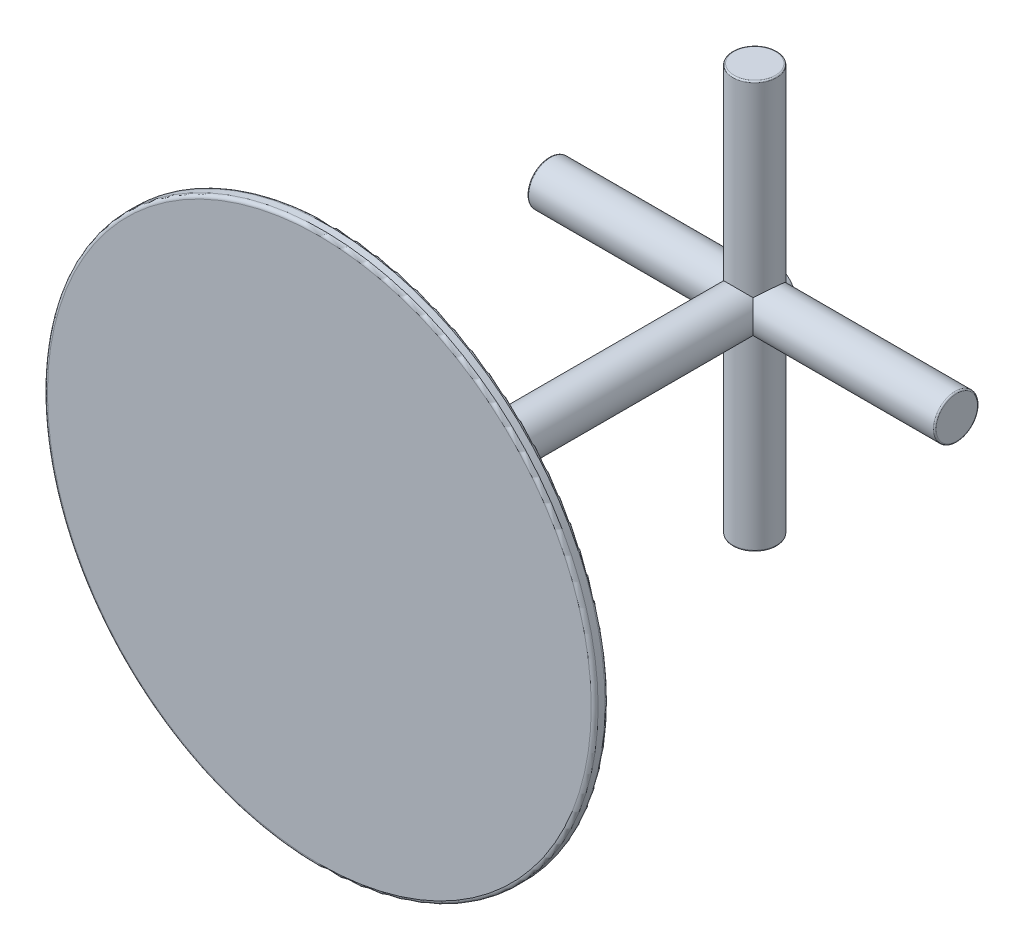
ISO-10303-21;
HEADER;
FILE_DESCRIPTION(('STEP AP214'),'2;1');
FILE_NAME('part.step','',(''),(''),'','','');
FILE_SCHEMA(('AUTOMOTIVE_DESIGN { 1 0 10303 214 1 1 1 1 }'));
ENDSEC;
DATA;
#1=APPLICATION_CONTEXT('core data for automotive mechanical design processes');
#2=APPLICATION_PROTOCOL_DEFINITION('international standard','automotive_design',2000,#1);
#3=PRODUCT_CONTEXT('',#1,'mechanical');
#4=PRODUCT('Part','Part','',(#3));
#5=PRODUCT_RELATED_PRODUCT_CATEGORY('part','',(#4));
#6=PRODUCT_DEFINITION_FORMATION('','',#4);
#7=PRODUCT_DEFINITION_CONTEXT('part definition',#1,'design');
#8=PRODUCT_DEFINITION('design','',#6,#7);
#9=PRODUCT_DEFINITION_SHAPE('','',#8);
#10=(LENGTH_UNIT() NAMED_UNIT(*) SI_UNIT(.MILLI.,.METRE.));
#11=(NAMED_UNIT(*) PLANE_ANGLE_UNIT() SI_UNIT($,.RADIAN.));
#12=(NAMED_UNIT(*) SI_UNIT($,.STERADIAN.) SOLID_ANGLE_UNIT());
#13=UNCERTAINTY_MEASURE_WITH_UNIT(LENGTH_MEASURE(1.E-05),#10,'distance_accuracy_value','');
#14=(GEOMETRIC_REPRESENTATION_CONTEXT(3) GLOBAL_UNCERTAINTY_ASSIGNED_CONTEXT((#13)) GLOBAL_UNIT_ASSIGNED_CONTEXT((#10,
#11,#12)) REPRESENTATION_CONTEXT('',''));
#15=CARTESIAN_POINT('',(0.,0.,0.));
#16=DIRECTION('',(0.,0.,1.));
#17=DIRECTION('',(1.,0.,0.));
#18=AXIS2_PLACEMENT_3D('',#15,#16,#17);
#19=CARTESIAN_POINT('',(0.,0.,-812.8));
#20=DIRECTION('',(0.,0.,1.));
#21=DIRECTION('',(1.,0.,0.));
#22=AXIS2_PLACEMENT_3D('',#19,#20,#21);
#23=CYLINDRICAL_SURFACE('',#22,40.64);
#24=CARTESIAN_POINT('',(0.,0.,0.));
#25=DIRECTION('',(0.,0.,1.));
#26=DIRECTION('',(1.,0.,0.));
#27=AXIS2_PLACEMENT_3D('',#24,#25,#26);
#28=CIRCLE('',#27,40.64);
#29=CARTESIAN_POINT('',(40.64,0.,0.));
#30=VERTEX_POINT('',#29);
#31=EDGE_CURVE('E268',#30,#30,#28,.F.);
#32=ORIENTED_EDGE('',*,*,#31,.T.);
#33=EDGE_LOOP('',(#32));
#34=FACE_BOUND('',#33,.T.);
#35=CARTESIAN_POINT('',(0.,0.,-777.887828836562));
#36=DIRECTION('',(0.,-0.707106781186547,0.707106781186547));
#37=DIRECTION('',(0.,0.707106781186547,0.707106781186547));
#38=AXIS2_PLACEMENT_3D('',#35,#36,#37);
#39=ELLIPSE('',#38,57.4736391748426,40.64);
#40=CARTESIAN_POINT('',(-27.1040751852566,30.2816563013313,-747.60617253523));
#41=VERTEX_POINT('',#40);
#42=CARTESIAN_POINT('',(27.1040751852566,30.2816563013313,-747.60617253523));
#43=VERTEX_POINT('',#42);
#44=EDGE_CURVE('E277',#41,#43,#39,.F.);
#45=ORIENTED_EDGE('',*,*,#44,.F.);
#46=CARTESIAN_POINT('',(0.,0.,-774.710247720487));
#47=DIRECTION('',(0.707106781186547,0.,0.707106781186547));
#48=DIRECTION('',(-0.707106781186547,0.,0.707106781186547));
#49=AXIS2_PLACEMENT_3D('',#46,#47,#48);
#50=ELLIPSE('',#49,57.4736391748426,40.64);
#51=CARTESIAN_POINT('',(-27.1040751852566,-30.2816563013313,-747.60617253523));
#52=VERTEX_POINT('',#51);
#53=EDGE_CURVE('E130',#52,#41,#50,.F.);
#54=ORIENTED_EDGE('',*,*,#53,.F.);
#55=CARTESIAN_POINT('',(0.,0.,-777.887828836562));
#56=DIRECTION('',(0.,0.707106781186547,0.707106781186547));
#57=DIRECTION('',(0.,-0.707106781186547,0.707106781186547));
#58=AXIS2_PLACEMENT_3D('',#55,#56,#57);
#59=ELLIPSE('',#58,57.4736391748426,40.64);
#60=CARTESIAN_POINT('',(27.1040751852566,-30.2816563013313,-747.60617253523));
#61=VERTEX_POINT('',#60);
#62=EDGE_CURVE('E49',#61,#52,#59,.F.);
#63=ORIENTED_EDGE('',*,*,#62,.F.);
#64=CARTESIAN_POINT('',(0.,0.,-774.710247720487));
#65=DIRECTION('',(-0.707106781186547,0.,0.707106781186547));
#66=DIRECTION('',(0.707106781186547,0.,0.707106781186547));
#67=AXIS2_PLACEMENT_3D('',#64,#65,#66);
#68=ELLIPSE('',#67,57.4736391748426,40.64);
#69=EDGE_CURVE('E122',#43,#61,#68,.F.);
#70=ORIENTED_EDGE('',*,*,#69,.F.);
#71=EDGE_LOOP('',(#45,#54,#63,#70));
#72=FACE_BOUND('',#71,.T.);
#73=ADVANCED_FACE('F34',(#34,#72),#23,.T.);
#74=CARTESIAN_POINT('',(375.92,0.,-774.710247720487));
#75=DIRECTION('',(-1.,0.,0.));
#76=DIRECTION('',(0.,0.,1.));
#77=AXIS2_PLACEMENT_3D('',#74,#75,#76);
#78=CYLINDRICAL_SURFACE('',#77,40.64);
#79=CARTESIAN_POINT('',(373.38,0.,-774.710247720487));
#80=DIRECTION('',(1.,0.,0.));
#81=DIRECTION('',(0.,0.,-1.));
#82=AXIS2_PLACEMENT_3D('',#79,#80,#81);
#83=CIRCLE('',#82,40.64);
#84=CARTESIAN_POINT('',(373.38,0.,-815.350247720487));
#85=VERTEX_POINT('',#84);
#86=EDGE_CURVE('E42',#85,#85,#83,.F.);
#87=ORIENTED_EDGE('',*,*,#86,.T.);
#88=EDGE_LOOP('',(#87));
#89=FACE_BOUND('',#88,.T.);
#90=CARTESIAN_POINT('',(15.7536272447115,0.,-815.350247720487));
#91=CARTESIAN_POINT('',(15.7536463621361,-0.572463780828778,-815.350243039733));
#92=CARTESIAN_POINT('',(15.7825989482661,-1.14500885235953,-815.338104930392));
#93=CARTESIAN_POINT('',(15.8961397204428,-2.28353403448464,-815.290047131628));
#94=CARTESIAN_POINT('',(15.980743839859,-2.84951221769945,-815.254120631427));
#95=CARTESIAN_POINT('',(16.1999254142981,-3.97201147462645,-815.159616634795));
#96=CARTESIAN_POINT('',(16.3347071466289,-4.52848402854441,-815.100946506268));
#97=CARTESIAN_POINT('',(16.6462870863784,-5.62703430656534,-814.962613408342));
#98=CARTESIAN_POINT('',(16.8231108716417,-6.16910304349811,-814.882937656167));
#99=CARTESIAN_POINT('',(17.1664936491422,-7.11587647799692,-814.724607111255));
#100=CARTESIAN_POINT('',(17.3262256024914,-7.52375962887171,-814.649849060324));
#101=CARTESIAN_POINT('',(17.6624950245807,-8.33015017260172,-814.489476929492));
#102=CARTESIAN_POINT('',(17.8390268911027,-8.72866063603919,-814.403866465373));
#103=CARTESIAN_POINT('',(18.3896560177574,-9.91146514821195,-814.131410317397));
#104=CARTESIAN_POINT('',(18.7845930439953,-10.6825199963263,-813.92902709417));
#105=CARTESIAN_POINT('',(19.6124136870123,-12.1952089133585,-813.485365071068));
#106=CARTESIAN_POINT('',(20.0454133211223,-12.9367422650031,-813.243965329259));
#107=CARTESIAN_POINT('',(20.935212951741,-14.3918253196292,-812.724474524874));
#108=CARTESIAN_POINT('',(21.3920082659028,-15.1053804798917,-812.446390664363));
#109=CARTESIAN_POINT('',(22.2681748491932,-16.4292000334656,-811.887494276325));
#110=CARTESIAN_POINT('',(22.686016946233,-17.0420903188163,-811.610466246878));
#111=CARTESIAN_POINT('',(23.5282792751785,-18.2498506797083,-811.028314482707));
#112=CARTESIAN_POINT('',(23.9527002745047,-18.8447186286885,-810.723187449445));
#113=CARTESIAN_POINT('',(24.8043713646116,-20.0176494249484,-810.084665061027));
#114=CARTESIAN_POINT('',(25.2316230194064,-20.5957018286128,-809.751252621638));
#115=CARTESIAN_POINT('',(26.0853899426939,-21.7350627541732,-809.056163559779));
#116=CARTESIAN_POINT('',(26.5119052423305,-22.2963720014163,-808.694488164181));
#117=CARTESIAN_POINT('',(27.3606589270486,-23.4014297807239,-807.943187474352));
#118=CARTESIAN_POINT('',(27.7829032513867,-23.9452059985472,-807.553609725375));
#119=CARTESIAN_POINT('',(28.6212046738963,-25.0158091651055,-806.745675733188));
#120=CARTESIAN_POINT('',(29.0372615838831,-25.5426355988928,-806.327318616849));
#121=CARTESIAN_POINT('',(30.2720524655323,-27.0963191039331,-805.028900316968));
#122=CARTESIAN_POINT('',(31.0781230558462,-28.097304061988,-804.104866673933));
#123=CARTESIAN_POINT('',(32.4094532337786,-29.740581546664,-802.424104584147));
#124=CARTESIAN_POINT('',(32.9481565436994,-30.4024732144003,-801.696964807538));
#125=CARTESIAN_POINT('',(33.9915473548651,-31.6825325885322,-800.181994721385));
#126=CARTESIAN_POINT('',(34.4962360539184,-32.30070183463,-799.39416655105));
#127=CARTESIAN_POINT('',(35.4633177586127,-33.4870581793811,-797.759011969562));
#128=CARTESIAN_POINT('',(35.9257637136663,-34.0553078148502,-796.911762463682));
#129=CARTESIAN_POINT('',(36.8009091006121,-35.1362357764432,-795.158102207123));
#130=CARTESIAN_POINT('',(37.213618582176,-35.6489253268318,-794.251703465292));
#131=CARTESIAN_POINT('',(37.907212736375,-36.5193195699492,-792.561615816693));
#132=CARTESIAN_POINT('',(38.198207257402,-36.8879029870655,-791.78766438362));
#133=CARTESIAN_POINT('',(38.7373888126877,-37.579983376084,-790.205400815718));
#134=CARTESIAN_POINT('',(38.9855804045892,-37.903485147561,-789.397092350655));
#135=CARTESIAN_POINT('',(39.4344616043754,-38.5012127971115,-787.749934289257));
#136=CARTESIAN_POINT('',(39.6351698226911,-38.7754579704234,-786.911096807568));
#137=CARTESIAN_POINT('',(39.984888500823,-39.2709656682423,-785.207287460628));
#138=CARTESIAN_POINT('',(40.1338984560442,-39.4922276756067,-784.342315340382));
#139=CARTESIAN_POINT('',(40.377242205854,-39.879646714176,-782.58657771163));
#140=CARTESIAN_POINT('',(40.4712209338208,-40.0454429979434,-781.695682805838));
#141=CARTESIAN_POINT('',(40.6001008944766,-40.3174193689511,-779.90055705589));
#142=CARTESIAN_POINT('',(40.6350019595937,-40.4235992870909,-778.996326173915));
#143=CARTESIAN_POINT('',(40.6439970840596,-40.5749224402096,-777.182710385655));
#144=CARTESIAN_POINT('',(40.618108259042,-40.6200828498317,-776.273327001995));
#145=CARTESIAN_POINT('',(40.5051767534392,-40.6493555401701,-774.457429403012));
#146=CARTESIAN_POINT('',(40.4181385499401,-40.6334722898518,-773.550914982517));
#147=CARTESIAN_POINT('',(40.1958795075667,-40.5466695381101,-771.840764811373));
#148=CARTESIAN_POINT('',(40.0664766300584,-40.4815270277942,-771.036064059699));
#149=CARTESIAN_POINT('',(39.7607590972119,-40.3049271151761,-769.440873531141));
#150=CARTESIAN_POINT('',(39.5844483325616,-40.1934735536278,-768.650382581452));
#151=CARTESIAN_POINT('',(39.1870975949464,-39.9267193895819,-767.088260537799));
#152=CARTESIAN_POINT('',(38.9660537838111,-39.7714150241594,-766.316631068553));
#153=CARTESIAN_POINT('',(38.4818997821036,-39.4199317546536,-764.796243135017));
#154=CARTESIAN_POINT('',(38.218787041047,-39.2237503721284,-764.047486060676));
#155=CARTESIAN_POINT('',(37.6385176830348,-38.7824576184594,-762.537257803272));
#156=CARTESIAN_POINT('',(37.3192432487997,-38.5353120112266,-761.777197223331));
#157=CARTESIAN_POINT('',(36.6408586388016,-38.0033671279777,-760.288792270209));
#158=CARTESIAN_POINT('',(36.2817482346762,-37.7185676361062,-759.560448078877));
#159=CARTESIAN_POINT('',(35.5270820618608,-37.1152691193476,-758.137259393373));
#160=CARTESIAN_POINT('',(35.1315189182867,-36.796763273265,-757.44242172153));
#161=CARTESIAN_POINT('',(34.3071791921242,-36.1299275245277,-756.087459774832));
#162=CARTESIAN_POINT('',(33.878395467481,-35.7815912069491,-755.427343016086));
#163=CARTESIAN_POINT('',(33.0920202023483,-35.1413962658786,-754.289292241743));
#164=CARTESIAN_POINT('',(32.7405123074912,-34.8547896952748,-753.804160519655));
#165=CARTESIAN_POINT('',(32.0208506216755,-34.2677774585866,-752.855264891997));
#166=CARTESIAN_POINT('',(31.652699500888,-33.9673740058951,-752.391497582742));
#167=CARTESIAN_POINT('',(30.5245136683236,-33.0474502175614,-751.031702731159));
#168=CARTESIAN_POINT('',(29.7409434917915,-32.4093775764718,-750.167465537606));
#169=CARTESIAN_POINT('',(28.1166632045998,-31.0942442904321,-748.521102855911));
#170=CARTESIAN_POINT('',(27.2757954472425,-30.4170769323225,-747.739220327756));
#171=CARTESIAN_POINT('',(25.5440407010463,-29.0368008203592,-746.258582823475));
#172=CARTESIAN_POINT('',(24.653163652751,-28.3336972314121,-745.559811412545));
#173=CARTESIAN_POINT('',(23.269554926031,-27.259237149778,-744.56409301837));
#174=CARTESIAN_POINT('',(22.794129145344,-26.893009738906,-744.237133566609));
#175=CARTESIAN_POINT('',(21.8308951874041,-26.1585642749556,-743.604397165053));
#176=CARTESIAN_POINT('',(21.3430878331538,-25.7903463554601,-743.298618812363));
#177=CARTESIAN_POINT('',(20.3547489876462,-25.0536261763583,-742.707928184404));
#178=CARTESIAN_POINT('',(19.8542111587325,-24.6851238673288,-742.423026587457));
#179=CARTESIAN_POINT('',(18.8403146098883,-23.9501803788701,-741.874158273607));
#180=CARTESIAN_POINT('',(18.326956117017,-23.5837391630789,-741.610191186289));
#181=CARTESIAN_POINT('',(17.2881049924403,-22.8563498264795,-741.103808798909));
#182=CARTESIAN_POINT('',(16.7626456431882,-22.495390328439,-740.861341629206));
#183=CARTESIAN_POINT('',(15.6974301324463,-21.7810544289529,-740.397325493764));
#184=CARTESIAN_POINT('',(15.157672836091,-21.4276786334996,-740.175778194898));
#185=CARTESIAN_POINT('',(14.0631790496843,-20.7326628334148,-739.754113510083));
#186=CARTESIAN_POINT('',(13.5084566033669,-20.3910124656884,-739.553976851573));
#187=CARTESIAN_POINT('',(12.3821301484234,-19.7240285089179,-739.17548741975));
#188=CARTESIAN_POINT('',(11.8105302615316,-19.3986909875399,-738.997129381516));
#189=CARTESIAN_POINT('',(10.7352464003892,-18.8174686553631,-738.687974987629));
#190=CARTESIAN_POINT('',(10.2341551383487,-18.5584641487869,-738.554052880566));
#191=CARTESIAN_POINT('',(9.21720433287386,-18.0617936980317,-738.303400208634));
#192=CARTESIAN_POINT('',(8.70134477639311,-17.824127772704,-738.186669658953));
#193=CARTESIAN_POINT('',(7.65485229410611,-17.3767061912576,-737.97169580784));
#194=CARTESIAN_POINT('',(7.12424579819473,-17.1669040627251,-737.873421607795));
#195=CARTESIAN_POINT('',(6.04724761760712,-16.782179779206,-737.696561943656));
#196=CARTESIAN_POINT('',(5.50085948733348,-16.6072498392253,-737.617972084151));
#197=CARTESIAN_POINT('',(4.49619421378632,-16.3289795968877,-737.494757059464));
#198=CARTESIAN_POINT('',(4.04038028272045,-16.2183784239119,-737.446535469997));
#199=CARTESIAN_POINT('',(3.12061733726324,-16.0301822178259,-737.365188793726));
#200=CARTESIAN_POINT('',(2.65666942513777,-15.9525827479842,-737.332061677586));
#201=CARTESIAN_POINT('',(1.7239800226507,-15.8341383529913,-737.281731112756));
#202=CARTESIAN_POINT('',(1.25524795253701,-15.7932315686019,-737.264500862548));
#203=CARTESIAN_POINT('',(0.315668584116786,-15.7501020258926,-737.246338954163));
#204=CARTESIAN_POINT('',(-0.155178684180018,-15.7478787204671,-737.245407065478));
#205=CARTESIAN_POINT('',(-1.09528292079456,-15.7822413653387,-737.259870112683));
#206=CARTESIAN_POINT('',(-1.56453951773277,-15.8188358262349,-737.275268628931));
#207=CARTESIAN_POINT('',(-2.49785810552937,-15.928904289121,-737.321972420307));
#208=CARTESIAN_POINT('',(-2.96191984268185,-16.0023800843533,-737.35327846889));
#209=CARTESIAN_POINT('',(-3.88307539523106,-16.1828818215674,-737.431117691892));
#210=CARTESIAN_POINT('',(-4.3401530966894,-16.2899757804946,-737.477681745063));
#211=CARTESIAN_POINT('',(-5.24470119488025,-16.5333122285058,-737.585096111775));
#212=CARTESIAN_POINT('',(-5.69217043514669,-16.6695582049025,-737.6459481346));
#213=CARTESIAN_POINT('',(-6.8993241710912,-17.0750239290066,-737.830275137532));
#214=CARTESIAN_POINT('',(-7.64876216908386,-17.3687656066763,-737.967059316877));
#215=CARTESIAN_POINT('',(-9.11708842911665,-18.0089623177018,-738.276562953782));
#216=CARTESIAN_POINT('',(-9.83595004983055,-18.3554621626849,-738.449313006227));
#217=CARTESIAN_POINT('',(-11.2484871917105,-19.0864437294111,-738.828670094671));
#218=CARTESIAN_POINT('',(-11.9420494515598,-19.4710729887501,-739.035410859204));
#219=CARTESIAN_POINT('',(-13.3039742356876,-20.2651919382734,-739.480446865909));
#220=CARTESIAN_POINT('',(-13.9723418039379,-20.6746766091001,-739.718735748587));
#221=CARTESIAN_POINT('',(-15.25563700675,-21.4901847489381,-740.213894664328));
#222=CARTESIAN_POINT('',(-15.8715961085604,-21.8954525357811,-740.469348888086));
#223=CARTESIAN_POINT('',(-17.0851715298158,-22.7153133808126,-741.007655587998));
#224=CARTESIAN_POINT('',(-17.6827851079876,-23.1299078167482,-741.290512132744));
#225=CARTESIAN_POINT('',(-18.8612082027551,-23.9642928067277,-741.883665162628));
#226=CARTESIAN_POINT('',(-19.4420059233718,-24.3840867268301,-742.193980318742));
#227=CARTESIAN_POINT('',(-20.5870796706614,-25.2250318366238,-742.841938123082));
#228=CARTESIAN_POINT('',(-21.1513565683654,-25.646182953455,-743.179579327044));
#229=CARTESIAN_POINT('',(-22.263082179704,-26.4863756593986,-743.881997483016));
#230=CARTESIAN_POINT('',(-22.8105498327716,-26.9054191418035,-744.246742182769));
#231=CARTESIAN_POINT('',(-23.8893026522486,-27.7392620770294,-745.004016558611));
#232=CARTESIAN_POINT('',(-24.4205873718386,-28.1540614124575,-745.396547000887));
#233=CARTESIAN_POINT('',(-25.4663155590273,-28.9767639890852,-746.20952818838));
#234=CARTESIAN_POINT('',(-25.9807675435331,-29.384670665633,-746.629964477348));
#235=CARTESIAN_POINT('',(-26.992371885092,-30.1914302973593,-747.499242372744));
#236=CARTESIAN_POINT('',(-27.4895254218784,-30.5902838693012,-747.948082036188));
#237=CARTESIAN_POINT('',(-28.7059580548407,-31.5702873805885,-749.102659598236));
#238=CARTESIAN_POINT('',(-29.4141370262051,-32.1445452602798,-749.826113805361));
#239=CARTESIAN_POINT('',(-30.7857174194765,-33.260074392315,-751.338043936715));
#240=CARTESIAN_POINT('',(-31.4491188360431,-33.8013456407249,-752.126519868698));
#241=CARTESIAN_POINT('',(-32.7248332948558,-34.8420467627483,-753.767856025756));
#242=CARTESIAN_POINT('',(-33.3372189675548,-35.3415361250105,-754.620621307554));
#243=CARTESIAN_POINT('',(-34.2129024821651,-36.0531505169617,-755.947732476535));
#244=CARTESIAN_POINT('',(-34.4976328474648,-36.2840733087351,-756.398069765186));
#245=CARTESIAN_POINT('',(-35.0520106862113,-36.7323469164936,-757.314712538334));
#246=CARTESIAN_POINT('',(-35.3216543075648,-36.9496942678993,-757.781022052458));
#247=CARTESIAN_POINT('',(-35.9975702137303,-37.4921785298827,-759.006093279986));
#248=CARTESIAN_POINT('',(-36.3916832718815,-37.8061477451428,-759.776628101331));
#249=CARTESIAN_POINT('',(-37.1350610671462,-38.3918811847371,-761.354314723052));
#250=CARTESIAN_POINT('',(-37.4843359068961,-38.6636549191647,-762.161458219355));
#251=CARTESIAN_POINT('',(-38.1337583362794,-39.160121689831,-763.809129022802));
#252=CARTESIAN_POINT('',(-38.4339207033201,-39.3848288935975,-764.649646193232));
#253=CARTESIAN_POINT('',(-38.9810357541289,-39.7825468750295,-766.359846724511));
#254=CARTESIAN_POINT('',(-39.2279878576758,-39.955557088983,-767.229530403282));
#255=CARTESIAN_POINT('',(-39.6664660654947,-40.246696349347,-768.998657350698));
#256=CARTESIAN_POINT('',(-39.8575819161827,-40.3644228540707,-769.89826933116));
#257=CARTESIAN_POINT('',(-40.1789179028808,-40.5396714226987,-771.714157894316));
#258=CARTESIAN_POINT('',(-40.3091378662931,-40.5971933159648,-772.630434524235));
#259=CARTESIAN_POINT('',(-40.5066976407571,-40.6497214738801,-774.471173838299));
#260=CARTESIAN_POINT('',(-40.5740628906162,-40.6447530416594,-775.395633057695));
#261=CARTESIAN_POINT('',(-40.6454328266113,-40.5714568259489,-777.244436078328));
#262=CARTESIAN_POINT('',(-40.6494432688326,-40.5031347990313,-778.168779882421));
#263=CARTESIAN_POINT('',(-40.5981452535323,-40.3150600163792,-779.904384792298));
#264=CARTESIAN_POINT('',(-40.549508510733,-40.2020141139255,-780.716588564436));
#265=CARTESIAN_POINT('',(-40.4047626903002,-39.9279386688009,-782.32848272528));
#266=CARTESIAN_POINT('',(-40.3086579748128,-39.7669135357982,-783.128174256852));
#267=CARTESIAN_POINT('',(-40.0712671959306,-39.398892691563,-784.710071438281));
#268=CARTESIAN_POINT('',(-39.9299781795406,-39.1918939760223,-785.492275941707));
#269=CARTESIAN_POINT('',(-39.6050823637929,-38.7344869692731,-787.034875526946));
#270=CARTESIAN_POINT('',(-39.421473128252,-38.4840761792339,-787.795269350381));
#271=CARTESIAN_POINT('',(-39.0077120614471,-37.9327973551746,-789.318198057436));
#272=CARTESIAN_POINT('',(-38.7760978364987,-37.6304132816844,-790.079784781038));
#273=CARTESIAN_POINT('',(-38.2747163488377,-36.9855163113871,-791.57270487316));
#274=CARTESIAN_POINT('',(-38.0049492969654,-36.6430036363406,-792.304038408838));
#275=CARTESIAN_POINT('',(-37.431093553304,-35.92115737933,-793.734498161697));
#276=CARTESIAN_POINT('',(-37.1269967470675,-35.5418150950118,-794.433616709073));
#277=CARTESIAN_POINT('',(-36.4882854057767,-34.7495243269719,-795.798225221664));
#278=CARTESIAN_POINT('',(-36.1536643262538,-34.3365686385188,-796.463707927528));
#279=CARTESIAN_POINT('',(-35.539883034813,-33.5813139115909,-797.606908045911));
#280=CARTESIAN_POINT('',(-35.2662902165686,-33.2453630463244,-798.09184978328));
#281=CARTESIAN_POINT('',(-34.7051158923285,-32.5569367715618,-799.041282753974));
#282=CARTESIAN_POINT('',(-34.4175366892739,-32.2044640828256,-799.505777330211));
#283=CARTESIAN_POINT('',(-33.5357284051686,-31.1235086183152,-800.869039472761));
#284=CARTESIAN_POINT('',(-32.922573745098,-30.3716661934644,-801.737318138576));
#285=CARTESIAN_POINT('',(-31.6560460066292,-28.8117434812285,-803.394598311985));
#286=CARTESIAN_POINT('',(-31.0025760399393,-28.0035270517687,-804.183395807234));
#287=CARTESIAN_POINT('',(-29.6675350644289,-26.3379001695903,-805.680856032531));
#288=CARTESIAN_POINT('',(-28.9859687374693,-25.4804979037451,-806.389532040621));
#289=CARTESIAN_POINT('',(-27.9420049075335,-24.148876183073,-807.402185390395));
#290=CARTESIAN_POINT('',(-27.585871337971,-23.6914650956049,-807.735131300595));
#291=CARTESIAN_POINT('',(-26.8706271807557,-22.7647491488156,-808.380630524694));
#292=CARTESIAN_POINT('',(-26.511516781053,-22.2954450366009,-808.693185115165));
#293=CARTESIAN_POINT('',(-25.7918417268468,-21.344801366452,-809.298202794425));
#294=CARTESIAN_POINT('',(-25.4312765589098,-20.8634571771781,-809.590657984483));
#295=CARTESIAN_POINT('',(-24.7106986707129,-19.8887721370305,-810.155467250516));
#296=CARTESIAN_POINT('',(-24.3506859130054,-19.3954321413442,-810.427822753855));
#297=CARTESIAN_POINT('',(-23.6340383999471,-18.3973665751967,-810.95198595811));
#298=CARTESIAN_POINT('',(-23.2773982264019,-17.8926664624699,-811.203834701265));
#299=CARTESIAN_POINT('',(-22.5692077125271,-16.8702437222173,-811.687597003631));
#300=CARTESIAN_POINT('',(-22.2176576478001,-16.3525203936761,-811.91950948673));
#301=CARTESIAN_POINT('',(-21.5229113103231,-15.3035032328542,-812.363089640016));
#302=CARTESIAN_POINT('',(-21.1797097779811,-14.7722184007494,-812.57477031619));
#303=CARTESIAN_POINT('',(-20.505238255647,-13.6946199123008,-812.977699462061));
#304=CARTESIAN_POINT('',(-20.1739662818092,-13.1483087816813,-813.168951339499));
#305=CARTESIAN_POINT('',(-19.5596352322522,-12.0931830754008,-813.5128457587));
#306=CARTESIAN_POINT('',(-19.2750255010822,-11.5859099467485,-813.667434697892));
#307=CARTESIAN_POINT('',(-18.7239464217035,-10.5565526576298,-813.958877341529));
#308=CARTESIAN_POINT('',(-18.4574768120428,-10.0344687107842,-814.095731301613));
#309=CARTESIAN_POINT('',(-17.9485646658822,-8.97455287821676,-814.350680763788));
#310=CARTESIAN_POINT('',(-17.7061078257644,-8.4367306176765,-814.468787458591));
#311=CARTESIAN_POINT('',(-17.2522146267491,-7.34414461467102,-814.685028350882));
#312=CARTESIAN_POINT('',(-17.0407730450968,-6.78938374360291,-814.783165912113));
#313=CARTESIAN_POINT('',(-16.6919752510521,-5.76434573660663,-814.942079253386));
#314=CARTESIAN_POINT('',(-16.5481344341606,-5.29683887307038,-815.006400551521));
#315=CARTESIAN_POINT('',(-16.2922560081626,-4.3513954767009,-815.11942292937));
#316=CARTESIAN_POINT('',(-16.180207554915,-3.87346256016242,-815.168129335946));
#317=CARTESIAN_POINT('',(-15.9930755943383,-2.91014882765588,-815.248792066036));
#318=CARTESIAN_POINT('',(-15.9179014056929,-2.42478934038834,-815.280789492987));
#319=CARTESIAN_POINT('',(-15.8080617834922,-1.44863504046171,-815.327358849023));
#320=CARTESIAN_POINT('',(-15.7733934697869,-0.957840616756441,-815.341932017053));
#321=CARTESIAN_POINT('',(-15.7465144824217,0.0276978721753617,-815.353241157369));
#322=CARTESIAN_POINT('',(-15.7545258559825,0.522449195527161,-815.349883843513));
#323=CARTESIAN_POINT('',(-15.8130361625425,1.50895144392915,-815.325222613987));
#324=CARTESIAN_POINT('',(-15.8635366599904,2.00070225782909,-815.303918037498));
#325=CARTESIAN_POINT('',(-16.0042911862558,2.9784150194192,-815.243926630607));
#326=CARTESIAN_POINT('',(-16.0946316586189,3.46436200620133,-815.205201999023));
#327=CARTESIAN_POINT('',(-16.3105451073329,4.42668435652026,-815.11133653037));
#328=CARTESIAN_POINT('',(-16.4361239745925,4.90305810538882,-815.056192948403));
#329=CARTESIAN_POINT('',(-16.7892727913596,6.08572329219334,-814.898420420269));
#330=CARTESIAN_POINT('',(-17.0361503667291,6.78493109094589,-814.785931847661));
#331=CARTESIAN_POINT('',(-17.5812119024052,8.15699562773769,-814.529352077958));
#332=CARTESIAN_POINT('',(-17.8794308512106,8.82983400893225,-814.385239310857));
#333=CARTESIAN_POINT('',(-18.5140911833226,10.1531002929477,-814.067443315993));
#334=CARTESIAN_POINT('',(-18.850675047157,10.8034321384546,-813.893648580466));
#335=CARTESIAN_POINT('',(-19.550180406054,12.0813286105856,-813.518680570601));
#336=CARTESIAN_POINT('',(-19.9130981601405,12.7088964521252,-813.317511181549));
#337=CARTESIAN_POINT('',(-20.6569324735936,13.9433035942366,-812.88904180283));
#338=CARTESIAN_POINT('',(-21.0378348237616,14.5501586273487,-812.661762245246));
#339=CARTESIAN_POINT('',(-21.8119076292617,15.7457208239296,-812.18152874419));
#340=CARTESIAN_POINT('',(-22.205080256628,16.3344247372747,-811.928570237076));
#341=CARTESIAN_POINT('',(-22.9992614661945,17.4954686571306,-811.397112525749));
#342=CARTESIAN_POINT('',(-23.4002756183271,18.0677962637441,-811.11859460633));
#343=CARTESIAN_POINT('',(-24.206123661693,19.1965988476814,-810.536264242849));
#344=CARTESIAN_POINT('',(-24.6109573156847,19.753074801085,-810.232453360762));
#345=CARTESIAN_POINT('',(-25.4212522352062,20.8505810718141,-809.599557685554));
#346=CARTESIAN_POINT('',(-25.826713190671,21.3916173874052,-809.270482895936));
#347=CARTESIAN_POINT('',(-26.6358091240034,22.4587096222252,-808.586751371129));
#348=CARTESIAN_POINT('',(-27.0394440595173,22.984765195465,-808.232094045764));
#349=CARTESIAN_POINT('',(-27.8423520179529,24.0215590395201,-807.497102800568));
#350=CARTESIAN_POINT('',(-28.2416270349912,24.5323045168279,-807.116781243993));
#351=CARTESIAN_POINT('',(-29.0338018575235,25.5383196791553,-806.330044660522));
#352=CARTESIAN_POINT('',(-29.4267019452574,26.0335900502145,-805.923630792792));
#353=CARTESIAN_POINT('',(-30.4485026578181,27.3145119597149,-804.820448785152));
#354=CARTESIAN_POINT('',(-31.0705024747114,28.0869956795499,-804.101754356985));
#355=CARTESIAN_POINT('',(-32.2832318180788,29.5854481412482,-802.59288554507));
#356=CARTESIAN_POINT('',(-32.8739596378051,30.3114143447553,-801.802707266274));
#357=CARTESIAN_POINT('',(-34.0140595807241,31.7101820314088,-800.151205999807));
#358=CARTESIAN_POINT('',(-34.5634995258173,32.3830707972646,-799.290004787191));
#359=CARTESIAN_POINT('',(-35.349726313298,33.3478092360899,-797.944655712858));
#360=CARTESIAN_POINT('',(-35.6054616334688,33.6619339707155,-797.487318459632));
#361=CARTESIAN_POINT('',(-36.1031270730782,34.2744727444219,-796.554730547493));
#362=CARTESIAN_POINT('',(-36.3450537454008,34.572882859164,-796.079475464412));
#363=CARTESIAN_POINT('',(-36.9397524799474,35.3088344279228,-794.850970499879));
#364=CARTESIAN_POINT('',(-37.2821504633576,35.7348741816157,-794.085695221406));
#365=CARTESIAN_POINT('',(-37.9256877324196,36.5425571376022,-792.515592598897));
#366=CARTESIAN_POINT('',(-38.226836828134,36.9242108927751,-791.710774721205));
#367=CARTESIAN_POINT('',(-38.7826814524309,37.6386223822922,-790.064353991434));
#368=CARTESIAN_POINT('',(-39.0373887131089,37.9713924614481,-789.222760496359));
#369=CARTESIAN_POINT('',(-39.4952717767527,38.5835663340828,-787.506647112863));
#370=CARTESIAN_POINT('',(-39.6984469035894,38.8629694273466,-786.632126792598));
#371=CARTESIAN_POINT('',(-40.0498825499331,39.3661440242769,-784.848383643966));
#372=CARTESIAN_POINT('',(-40.1976841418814,39.5894457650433,-783.938936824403));
#373=CARTESIAN_POINT('',(-40.4318508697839,39.9737091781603,-782.099102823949));
#374=CARTESIAN_POINT('',(-40.5182158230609,40.1346706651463,-781.168715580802));
#375=CARTESIAN_POINT('',(-40.6264277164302,40.3915263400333,-779.295782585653));
#376=CARTESIAN_POINT('',(-40.648311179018,40.4874573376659,-778.353244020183));
#377=CARTESIAN_POINT('',(-40.626045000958,40.6131415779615,-776.464589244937));
#378=CARTESIAN_POINT('',(-40.5819028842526,40.6429023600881,-775.518473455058));
#379=CARTESIAN_POINT('',(-40.4373381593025,40.6370424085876,-773.750648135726));
#380=CARTESIAN_POINT('',(-40.3446903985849,40.6091724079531,-772.928254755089));
#381=CARTESIAN_POINT('',(-40.1099711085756,40.5044181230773,-771.29379561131));
#382=CARTESIAN_POINT('',(-39.9679045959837,40.4275388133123,-770.481728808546));
#383=CARTESIAN_POINT('',(-39.636126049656,40.2268162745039,-768.873310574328));
#384=CARTESIAN_POINT('',(-39.4464119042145,40.1029709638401,-768.076959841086));
#385=CARTESIAN_POINT('',(-39.0217566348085,39.8110315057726,-766.504714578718));
#386=CARTESIAN_POINT('',(-38.7868131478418,39.6429350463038,-765.728821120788));
#387=CARTESIAN_POINT('',(-38.2702862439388,39.2625367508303,-764.188723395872));
#388=CARTESIAN_POINT('',(-37.9879906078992,39.0495447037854,-763.424929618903));
#389=CARTESIAN_POINT('',(-37.3828576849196,38.5847701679,-761.925843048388));
#390=CARTESIAN_POINT('',(-37.0600212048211,38.3329884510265,-761.190549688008));
#391=CARTESIAN_POINT('',(-36.3770208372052,37.7943278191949,-759.750652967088));
#392=CARTESIAN_POINT('',(-36.0168477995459,37.5074402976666,-759.046057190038));
#393=CARTESIAN_POINT('',(-35.2623521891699,36.902280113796,-757.669210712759));
#394=CARTESIAN_POINT('',(-34.8680223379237,36.5840007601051,-756.996966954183));
#395=CARTESIAN_POINT('',(-34.1495324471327,36.0017789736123,-755.847910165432));
#396=CARTESIAN_POINT('',(-33.8320843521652,35.7438218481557,-755.363823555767));
#397=CARTESIAN_POINT('',(-33.1808177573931,35.213741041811,-754.414993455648));
#398=CARTESIAN_POINT('',(-32.8470020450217,34.9416197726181,-753.950246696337));
#399=CARTESIAN_POINT('',(-31.822254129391,34.1058349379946,-752.584678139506));
#400=CARTESIAN_POINT('',(-31.108178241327,33.5228781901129,-751.712777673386));
#401=CARTESIAN_POINT('',(-29.6246291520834,32.3153666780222,-750.044693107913));
#402=CARTESIAN_POINT('',(-28.8550362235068,31.6907222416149,-749.248681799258));
#403=CARTESIAN_POINT('',(-27.2675704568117,30.4111703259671,-747.73334169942));
#404=CARTESIAN_POINT('',(-26.4497043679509,29.7562670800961,-747.014002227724));
#405=CARTESIAN_POINT('',(-24.7486064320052,28.4095209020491,-745.633435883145));
#406=CARTESIAN_POINT('',(-23.8642587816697,27.7171650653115,-744.974084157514));
#407=CARTESIAN_POINT('',(-22.5041180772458,26.6710430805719,-744.042947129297));
#408=CARTESIAN_POINT('',(-22.0450390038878,26.3209999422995,-743.742161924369));
#409=CARTESIAN_POINT('',(-21.1156246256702,25.6199540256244,-743.159730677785));
#410=CARTESIAN_POINT('',(-20.6452900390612,25.2689513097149,-742.878083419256));
#411=CARTESIAN_POINT('',(-19.6940262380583,24.5683305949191,-742.334283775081));
#412=CARTESIAN_POINT('',(-19.2131170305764,24.2187112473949,-742.072098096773));
#413=CARTESIAN_POINT('',(-18.2395560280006,23.5222390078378,-741.56663643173));
#414=CARTESIAN_POINT('',(-17.7469051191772,23.1753859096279,-741.323359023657));
#415=CARTESIAN_POINT('',(-16.7494133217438,22.4868861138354,-740.855814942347));
#416=CARTESIAN_POINT('',(-16.244577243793,22.1452374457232,-740.631540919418));
#417=CARTESIAN_POINT('',(-15.2217217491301,21.4698702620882,-740.202069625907));
#418=CARTESIAN_POINT('',(-14.7037038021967,21.136150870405,-739.996870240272));
#419=CARTESIAN_POINT('',(-13.6621497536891,20.4856533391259,-739.609129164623));
#420=CARTESIAN_POINT('',(-13.1388539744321,20.1686844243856,-739.42626377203));
#421=CARTESIAN_POINT('',(-12.0770422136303,19.5500203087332,-739.07975575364));
#422=CARTESIAN_POINT('',(-11.5385266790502,19.2483246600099,-738.916112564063));
#423=CARTESIAN_POINT('',(-10.4445512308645,18.6655287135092,-738.608777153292));
#424=CARTESIAN_POINT('',(-9.88908517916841,18.3844360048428,-738.465092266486));
#425=CARTESIAN_POINT('',(-8.75992749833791,17.849971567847,-738.198918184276));
#426=CARTESIAN_POINT('',(-8.18623812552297,17.5965964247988,-738.076426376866));
#427=CARTESIAN_POINT('',(-7.12018885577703,17.1669218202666,-737.873407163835));
#428=CARTESIAN_POINT('',(-6.63084992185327,16.9848644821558,-737.78928574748));
#429=CARTESIAN_POINT('',(-5.63923717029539,16.6517614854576,-737.637860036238));
#430=CARTESIAN_POINT('',(-5.13696802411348,16.5007047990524,-737.570549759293));
#431=CARTESIAN_POINT('',(-4.12210746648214,16.2363160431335,-737.454207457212));
#432=CARTESIAN_POINT('',(-3.6095541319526,16.1228650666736,-737.405117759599));
#433=CARTESIAN_POINT('',(-2.57524735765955,15.9390073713,-737.32619013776));
#434=CARTESIAN_POINT('',(-2.05349500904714,15.8685955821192,-737.296349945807));
#435=CARTESIAN_POINT('',(-0.99906945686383,15.7746719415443,-737.256649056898));
#436=CARTESIAN_POINT('',(-0.466339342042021,15.7516911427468,-737.247014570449));
#437=CARTESIAN_POINT('',(0.598876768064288,15.7558203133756,-737.248751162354));
#438=CARTESIAN_POINT('',(1.13136276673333,15.7829295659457,-737.260121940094));
#439=CARTESIAN_POINT('',(2.19181922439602,15.8854581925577,-737.303499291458));
#440=CARTESIAN_POINT('',(2.71977828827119,15.9609757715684,-737.33554781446));
#441=CARTESIAN_POINT('',(3.7659483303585,16.155647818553,-737.419286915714));
#442=CARTESIAN_POINT('',(4.28415702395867,16.2748123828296,-737.470982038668));
#443=CARTESIAN_POINT('',(5.47173148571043,16.5945190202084,-737.612122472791));
#444=CARTESIAN_POINT('',(6.13654422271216,16.8088953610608,-737.70835057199));
#445=CARTESIAN_POINT('',(7.44276139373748,17.287802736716,-737.929670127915));
#446=CARTESIAN_POINT('',(8.08415402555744,17.5523586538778,-738.054775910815));
#447=CARTESIAN_POINT('',(9.3465640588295,18.1197789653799,-738.331912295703));
#448=CARTESIAN_POINT('',(9.96749465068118,18.4227852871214,-738.484043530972));
#449=CARTESIAN_POINT('',(11.188261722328,19.0560744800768,-738.81313064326));
#450=CARTESIAN_POINT('',(11.788099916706,19.3863551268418,-738.990084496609));
#451=CARTESIAN_POINT('',(12.9795651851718,20.072638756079,-739.371095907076));
#452=CARTESIAN_POINT('',(13.5708453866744,20.4289999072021,-739.575587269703));
#453=CARTESIAN_POINT('',(14.7358330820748,21.1558625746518,-740.008401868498));
#454=CARTESIAN_POINT('',(15.3095370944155,21.5263668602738,-740.236729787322));
#455=CARTESIAN_POINT('',(16.4412255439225,22.2769935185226,-740.716956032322));
#456=CARTESIAN_POINT('',(16.999197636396,22.6571230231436,-740.968872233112));
#457=CARTESIAN_POINT('',(18.100054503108,23.4229607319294,-741.495934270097));
#458=CARTESIAN_POINT('',(18.642940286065,23.8086685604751,-741.771078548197));
#459=CARTESIAN_POINT('',(19.7144991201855,24.5827150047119,-742.344651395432));
#460=CARTESIAN_POINT('',(20.2431698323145,24.9710540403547,-742.643083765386));
#461=CARTESIAN_POINT('',(21.2866281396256,25.747749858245,-743.263308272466));
#462=CARTESIAN_POINT('',(21.8014154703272,26.1361066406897,-743.585100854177));
#463=CARTESIAN_POINT('',(22.8170052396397,26.9104324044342,-744.252092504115));
#464=CARTESIAN_POINT('',(23.3178138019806,27.2964023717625,-744.597281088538));
#465=CARTESIAN_POINT('',(24.3055031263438,28.0640783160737,-745.311403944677));
#466=CARTESIAN_POINT('',(24.792384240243,28.4457844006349,-745.680337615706));
#467=CARTESIAN_POINT('',(26.1238596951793,29.496602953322,-746.737603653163));
#468=CARTESIAN_POINT('',(26.9532554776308,30.159198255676,-747.451883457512));
#469=CARTESIAN_POINT('',(28.563630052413,31.4548970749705,-748.957842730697));
#470=CARTESIAN_POINT('',(29.3446036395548,32.0879974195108,-749.749530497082));
#471=CARTESIAN_POINT('',(30.8512628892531,33.3133788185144,-751.410231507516));
#472=CARTESIAN_POINT('',(31.5770482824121,33.9057333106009,-752.279098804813));
#473=CARTESIAN_POINT('',(32.6194369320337,34.7560485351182,-753.641000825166));
#474=CARTESIAN_POINT('',(32.9591549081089,35.0330930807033,-754.104688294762));
#475=CARTESIAN_POINT('',(33.6222645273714,35.5731596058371,-755.051735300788));
#476=CARTESIAN_POINT('',(33.9456521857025,35.8361781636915,-755.535099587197));
#477=CARTESIAN_POINT('',(34.7314464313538,36.4736736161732,-756.76666745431));
#478=CARTESIAN_POINT('',(35.1829390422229,36.8384731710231,-757.526951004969));
#479=CARTESIAN_POINT('',(36.0419256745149,37.5276595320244,-759.089326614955));
#480=CARTESIAN_POINT('',(36.4494305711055,37.8520563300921,-759.891408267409));
#481=CARTESIAN_POINT('',(37.2158047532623,38.4550142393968,-761.534991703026));
#482=CARTESIAN_POINT('',(37.574684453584,38.733585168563,-762.37648499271));
#483=CARTESIAN_POINT('',(38.2390620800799,39.2394692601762,-764.095346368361));
#484=CARTESIAN_POINT('',(38.5445591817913,39.4667816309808,-764.972715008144));
#485=CARTESIAN_POINT('',(39.0999275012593,39.8666596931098,-766.766051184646));
#486=CARTESIAN_POINT('',(39.3492844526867,40.0387249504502,-767.682290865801));
#487=CARTESIAN_POINT('',(39.7846585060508,40.320608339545,-769.539190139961));
#488=CARTESIAN_POINT('',(39.9706753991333,40.430426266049,-770.479849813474));
#489=CARTESIAN_POINT('',(40.2760263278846,40.5840912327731,-772.376625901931));
#490=CARTESIAN_POINT('',(40.3954072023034,40.6279846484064,-773.332730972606));
#491=CARTESIAN_POINT('',(40.5658436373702,40.647714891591,-775.251663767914));
#492=CARTESIAN_POINT('',(40.6169082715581,40.6235607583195,-776.214490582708));
#493=CARTESIAN_POINT('',(40.6483534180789,40.5145628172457,-778.008069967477));
#494=CARTESIAN_POINT('',(40.6372948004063,40.4382923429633,-778.839218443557));
#495=CARTESIAN_POINT('',(40.5648557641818,40.2350991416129,-780.493002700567));
#496=CARTESIAN_POINT('',(40.5034807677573,40.1081818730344,-781.315639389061));
#497=CARTESIAN_POINT('',(40.332245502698,39.805259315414,-782.946699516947));
#498=CARTESIAN_POINT('',(40.2223820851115,39.6292508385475,-783.75512202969));
#499=CARTESIAN_POINT('',(39.9567531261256,39.2304373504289,-785.352627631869));
#500=CARTESIAN_POINT('',(39.8009854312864,39.0076301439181,-786.141709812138));
#501=CARTESIAN_POINT('',(39.446571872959,38.517874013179,-787.696701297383));
#502=CARTESIAN_POINT('',(39.2478981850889,38.2508964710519,-788.46259519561));
#503=CARTESIAN_POINT('',(38.8112286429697,37.676025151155,-789.967225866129));
#504=CARTESIAN_POINT('',(38.5732340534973,37.3681326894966,-790.70596351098));
#505=CARTESIAN_POINT('',(38.061557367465,36.7146303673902,-792.153769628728));
#506=CARTESIAN_POINT('',(37.7878729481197,36.3690180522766,-792.862836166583));
#507=CARTESIAN_POINT('',(37.2084233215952,35.6431732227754,-794.249604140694));
#508=CARTESIAN_POINT('',(36.9026513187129,35.2629333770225,-794.927298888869));
#509=CARTESIAN_POINT('',(36.3446710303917,34.5724001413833,-796.080496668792));
#510=CARTESIAN_POINT('',(36.0988050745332,34.2691387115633,-796.563325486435));
#511=CARTESIAN_POINT('',(35.5928148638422,33.6463829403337,-797.510504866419));
#512=CARTESIAN_POINT('',(35.3326931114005,33.3268914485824,-797.974858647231));
#513=CARTESIAN_POINT('',(34.5327001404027,32.3453146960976,-799.340460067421));
#514=CARTESIAN_POINT('',(33.9733131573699,31.6602651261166,-800.214018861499));
#515=CARTESIAN_POINT('',(32.8115865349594,30.2348086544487,-801.888904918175));
#516=CARTESIAN_POINT('',(32.2091276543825,29.4942477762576,-802.690016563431));
#517=CARTESIAN_POINT('',(30.9723060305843,27.9652447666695,-804.21826120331));
#518=CARTESIAN_POINT('',(30.3379463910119,27.17680729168,-804.945401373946));
#519=CARTESIAN_POINT('',(29.2846987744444,25.854866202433,-806.072447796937));
#520=CARTESIAN_POINT('',(28.8725253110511,25.3344504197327,-806.494220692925));
#521=CARTESIAN_POINT('',(28.0415457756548,24.2767488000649,-807.309248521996));
#522=CARTESIAN_POINT('',(27.6227393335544,23.7394620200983,-807.702501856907));
#523=CARTESIAN_POINT('',(26.7807778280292,22.6480910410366,-808.46103308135));
#524=CARTESIAN_POINT('',(26.3576201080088,22.0939961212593,-808.826292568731));
#525=CARTESIAN_POINT('',(25.5099740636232,20.9693730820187,-809.528843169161));
#526=CARTESIAN_POINT('',(25.0854857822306,20.3988454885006,-809.866135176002));
#527=CARTESIAN_POINT('',(24.2389485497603,19.2418852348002,-810.512452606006));
#528=CARTESIAN_POINT('',(23.8168968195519,18.6554788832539,-810.821521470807));
#529=CARTESIAN_POINT('',(22.978209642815,17.4650423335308,-811.412065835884));
#530=CARTESIAN_POINT('',(22.5615746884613,16.8610105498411,-811.693538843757));
#531=CARTESIAN_POINT('',(21.7387616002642,15.6346828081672,-812.228421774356));
#532=CARTESIAN_POINT('',(21.332573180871,15.0124062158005,-812.481860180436));
#533=CARTESIAN_POINT('',(20.5361702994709,13.7472434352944,-812.960480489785));
#534=CARTESIAN_POINT('',(20.1459516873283,13.1043626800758,-813.185669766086));
#535=CARTESIAN_POINT('',(19.4553539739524,11.9097028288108,-813.570130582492));
#536=CARTESIAN_POINT('',(19.1511853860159,11.361617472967,-813.734046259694));
#537=CARTESIAN_POINT('',(18.5648706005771,10.2479856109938,-814.041177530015));
#538=CARTESIAN_POINT('',(18.2827251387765,9.68243852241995,-814.184392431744));
#539=CARTESIAN_POINT('',(17.7485522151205,8.53362585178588,-814.448560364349));
#540=CARTESIAN_POINT('',(17.4964617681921,7.95040065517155,-814.569560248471));
#541=CARTESIAN_POINT('',(17.0311742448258,6.76425379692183,-814.787893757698));
#542=CARTESIAN_POINT('',(16.8179631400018,6.16133933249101,-814.885235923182));
#543=CARTESIAN_POINT('',(16.4923006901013,5.10169453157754,-815.031285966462));
#544=CARTESIAN_POINT('',(16.3681827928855,4.64939049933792,-815.086030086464));
#545=CARTESIAN_POINT('',(16.1511388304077,3.73580159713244,-815.180782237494));
#546=CARTESIAN_POINT('',(16.0582079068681,3.2745181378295,-815.220792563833));
#547=CARTESIAN_POINT('',(15.9078166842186,2.34622905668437,-815.28512451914));
#548=CARTESIAN_POINT('',(15.8502680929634,1.87924066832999,-815.309485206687));
#549=CARTESIAN_POINT('',(15.7731641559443,0.941520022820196,-815.342049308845));
#550=CARTESIAN_POINT('',(15.7536115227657,0.470787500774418,-815.350251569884));
#551=CARTESIAN_POINT('',(15.7536272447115,0.,-815.350247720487));
#552=B_SPLINE_CURVE_WITH_KNOTS('',3,(#90,#91,#92,#93,#94,#95,#96,#97,#98,#99,#100,#101,#102,
#103,#104,#105,#106,#107,#108,#109,#110,#111,#112,#113,#114,#115,#116,#117,#118,#119,#120,#121,
#122,#123,#124,#125,#126,#127,#128,#129,#130,#131,#132,#133,#134,#135,#136,#137,#138,#139,#140,
#141,#142,#143,#144,#145,#146,#147,#148,#149,#150,#151,#152,#153,#154,#155,#156,#157,#158,#159,
#160,#161,#162,#163,#164,#165,#166,#167,#168,#169,#170,#171,#172,#173,#174,#175,#176,#177,#178,
#179,#180,#181,#182,#183,#184,#185,#186,#187,#188,#189,#190,#191,#192,#193,#194,#195,#196,#197,
#198,#199,#200,#201,#202,#203,#204,#205,#206,#207,#208,#209,#210,#211,#212,#213,#214,#215,#216,
#217,#218,#219,#220,#221,#222,#223,#224,#225,#226,#227,#228,#229,#230,#231,#232,#233,#234,#235,
#236,#237,#238,#239,#240,#241,#242,#243,#244,#245,#246,#247,#248,#249,#250,#251,#252,#253,#254,
#255,#256,#257,#258,#259,#260,#261,#262,#263,#264,#265,#266,#267,#268,#269,#270,#271,#272,#273,
#274,#275,#276,#277,#278,#279,#280,#281,#282,#283,#284,#285,#286,#287,#288,#289,#290,#291,#292,
#293,#294,#295,#296,#297,#298,#299,#300,#301,#302,#303,#304,#305,#306,#307,#308,#309,#310,#311,
#312,#313,#314,#315,#316,#317,#318,#319,#320,#321,#322,#323,#324,#325,#326,#327,#328,#329,#330,
#331,#332,#333,#334,#335,#336,#337,#338,#339,#340,#341,#342,#343,#344,#345,#346,#347,#348,#349,
#350,#351,#352,#353,#354,#355,#356,#357,#358,#359,#360,#361,#362,#363,#364,#365,#366,#367,#368,
#369,#370,#371,#372,#373,#374,#375,#376,#377,#378,#379,#380,#381,#382,#383,#384,#385,#386,#387,
#388,#389,#390,#391,#392,#393,#394,#395,#396,#397,#398,#399,#400,#401,#402,#403,#404,#405,#406,
#407,#408,#409,#410,#411,#412,#413,#414,#415,#416,#417,#418,#419,#420,#421,#422,#423,#424,#425,
#426,#427,#428,#429,#430,#431,#432,#433,#434,#435,#436,#437,#438,#439,#440,#441,#442,#443,#444,
#445,#446,#447,#448,#449,#450,#451,#452,#453,#454,#455,#456,#457,#458,#459,#460,#461,#462,#463,
#464,#465,#466,#467,#468,#469,#470,#471,#472,#473,#474,#475,#476,#477,#478,#479,#480,#481,#482,
#483,#484,#485,#486,#487,#488,#489,#490,#491,#492,#493,#494,#495,#496,#497,#498,#499,#500,#501,
#502,#503,#504,#505,#506,#507,#508,#509,#510,#511,#512,#513,#514,#515,#516,#517,#518,#519,#520,
#521,#522,#523,#524,#525,#526,#527,#528,#529,#530,#531,#532,#533,#534,#535,#536,#537,#538,#539,
#540,#541,#542,#543,#544,#545,#546,#547,#548,#549,#550,#551),.UNSPECIFIED.,.T.,.F.,(4,2,2,2,2,2,
2,2,2,2,2,2,2,2,2,2,2,2,2,2,2,2,2,2,2,2,2,2,2,2,2,2,2,2,2,2,2,2,2,2,2,2,2,2,2,2,2,2,2,2,2,2,2,2,
2,2,2,2,2,2,2,2,2,2,2,2,2,2,2,2,2,2,2,2,2,2,2,2,2,2,2,2,2,2,2,2,2,2,2,2,2,2,2,2,2,2,2,2,2,2,2,2,
2,2,2,2,2,2,2,2,2,2,2,2,2,2,2,2,2,2,2,2,2,2,2,2,2,2,2,2,2,2,2,2,2,2,2,2,2,2,2,2,2,2,2,2,2,2,2,2,
2,2,2,2,2,2,2,2,2,2,2,2,2,2,2,2,2,2,2,2,2,2,2,2,2,2,2,2,2,2,2,2,2,2,2,2,2,2,2,2,2,2,2,2,2,2,2,2,
2,2,2,2,2,2,2,2,2,2,2,2,2,2,2,2,2,2,2,2,2,2,2,2,2,2,2,2,2,2,2,2,4),(0.,1.71671359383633,
3.43391890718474,5.15819294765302,6.88351871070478,8.21607379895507,9.54818607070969,
12.2140681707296,14.8883782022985,17.5621639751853,19.936872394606,22.3118599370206,
24.688292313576,27.064621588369,29.4369937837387,31.809437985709,36.5503618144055,
39.9113391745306,43.2721981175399,46.6287848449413,49.9846922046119,52.6979922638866,
55.411003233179,58.122949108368,60.8349214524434,63.5642042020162,66.2934946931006,
69.0220168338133,71.7503392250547,74.2004642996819,76.6503862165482,79.1005184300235,
81.550799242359,84.1302513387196,86.7097182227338,89.2897081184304,91.870254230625,
93.8619054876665,95.8532383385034,99.83704237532,103.832288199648,107.826742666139,
109.876627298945,111.926376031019,113.977165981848,116.02791963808,118.073582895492,
120.119409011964,122.16337782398,124.206851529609,125.945407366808,127.683964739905,
129.419585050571,131.154817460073,132.568066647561,133.981125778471,135.39179816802,
136.802450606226,138.21341238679,139.62444277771,141.038346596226,142.452419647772,
144.897551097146,147.344771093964,149.801860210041,152.258454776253,154.59862556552,
156.939144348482,159.28126702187,161.623265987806,163.962521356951,166.301841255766,
168.6399586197,170.977916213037,174.466524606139,177.955133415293,181.438687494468,
183.180266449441,184.92228807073,187.681521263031,190.440131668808,193.197910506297,
195.955719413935,198.733308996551,201.510906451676,204.287379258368,207.063599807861,
209.525162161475,211.986498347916,214.447995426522,216.909634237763,219.461732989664,
222.013817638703,224.566506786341,227.119744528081,229.069942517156,231.019820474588,
234.920629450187,238.831208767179,242.741139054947,244.746335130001,246.751405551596,
248.757259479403,250.762970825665,252.764563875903,254.766264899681,256.766670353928,
258.766741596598,260.571690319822,262.376613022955,264.180454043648,265.983990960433,
267.462842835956,268.941189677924,270.415882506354,271.890470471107,273.372737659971,
274.85505942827,276.340613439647,277.826415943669,280.072505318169,282.320131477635,
284.5763950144,286.832338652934,289.086528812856,291.341120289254,293.597376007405,
295.853492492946,298.108720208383,300.363999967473,302.618200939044,304.872301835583,
308.543339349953,312.214577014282,315.879645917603,317.71190045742,319.544610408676,
322.363130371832,325.180978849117,327.99811449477,330.815287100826,333.655316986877,
336.495355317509,339.333784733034,342.17189072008,344.653123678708,347.134104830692,
349.615195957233,352.096416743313,354.619000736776,357.141534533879,359.664688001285,
362.18838046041,364.089000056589,365.989297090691,369.790852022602,373.600865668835,
377.41034787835,381.313961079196,383.266552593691,385.219019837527,387.168066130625,
389.116965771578,391.065108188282,393.013034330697,394.928115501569,396.843140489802,
398.758867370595,400.674357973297,402.259764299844,403.84460567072,405.424386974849,
407.003982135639,408.601169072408,410.198333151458,411.798747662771,413.399532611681,
415.511312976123,417.624143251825,419.745012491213,421.865708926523,424.024913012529,
426.184542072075,428.345821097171,430.506955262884,432.668442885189,434.829971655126,
436.990538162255,439.151050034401,442.985922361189,446.821206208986,450.649385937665,
452.563113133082,454.477305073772,457.344178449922,460.210341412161,463.075889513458,
465.941481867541,468.832343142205,471.723213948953,474.612050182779,477.500502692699,
480.001592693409,482.502413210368,485.003396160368,487.504496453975,490.007223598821,
492.509870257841,495.012679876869,497.516020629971,499.378127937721,501.239909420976,
504.964338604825,508.699510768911,512.43432023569,514.793227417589,517.152266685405,
519.512843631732,521.873345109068,524.230149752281,526.587167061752,528.941767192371,
531.295751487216,533.238698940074,535.181711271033,537.120577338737,539.058742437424,
540.474213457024,541.889463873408,543.301168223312,544.712973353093),.UNSPECIFIED.);
#553=CARTESIAN_POINT('',(30.2816563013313,-27.1040751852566,-804.991904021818));
#554=VERTEX_POINT('',#553);
#555=EDGE_CURVE('E136',#554,#61,#552,.T.);
#556=ORIENTED_EDGE('',*,*,#555,.F.);
#557=CARTESIAN_POINT('',(0.,0.,-774.710247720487));
#558=DIRECTION('',(0.707106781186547,0.,0.707106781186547));
#559=DIRECTION('',(-0.707106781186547,0.,0.707106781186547));
#560=AXIS2_PLACEMENT_3D('',#557,#558,#559);
#561=ELLIPSE('',#560,57.4736391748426,40.64);
#562=CARTESIAN_POINT('',(38.0897522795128,-14.169699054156,-812.8));
#563=VERTEX_POINT('',#562);
#564=EDGE_CURVE('E248',#554,#563,#561,.T.);
#565=ORIENTED_EDGE('',*,*,#564,.T.);
#566=DIRECTION('',(-1.,0.,0.));
#567=VECTOR('',#566,1.);
#568=CARTESIAN_POINT('',(375.92,-14.169699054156,-812.8));
#569=LINE('',#568,#567);
#570=CARTESIAN_POINT('',(20.802641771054,-14.169699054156,-812.8));
#571=VERTEX_POINT('',#570);
#572=EDGE_CURVE('E147',#571,#563,#569,.F.);
#573=ORIENTED_EDGE('',*,*,#572,.F.);
#574=CARTESIAN_POINT('',(20.802641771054,14.169699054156,-812.8));
#575=VERTEX_POINT('',#574);
#576=EDGE_CURVE('E260',#575,#571,#552,.T.);
#577=ORIENTED_EDGE('',*,*,#576,.F.);
#578=DIRECTION('',(-1.,0.,0.));
#579=VECTOR('',#578,1.);
#580=CARTESIAN_POINT('',(375.92,14.169699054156,-812.8));
#581=LINE('',#580,#579);
#582=CARTESIAN_POINT('',(38.0897522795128,14.169699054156,-812.8));
#583=VERTEX_POINT('',#582);
#584=EDGE_CURVE('E270',#583,#575,#581,.T.);
#585=ORIENTED_EDGE('',*,*,#584,.F.);
#586=CARTESIAN_POINT('',(30.2816563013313,27.1040751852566,-804.991904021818));
#587=VERTEX_POINT('',#586);
#588=EDGE_CURVE('E123',#583,#587,#561,.T.);
#589=ORIENTED_EDGE('',*,*,#588,.T.);
#590=EDGE_CURVE('E56',#43,#587,#552,.T.);
#591=ORIENTED_EDGE('',*,*,#590,.F.);
#592=ORIENTED_EDGE('',*,*,#69,.T.);
#593=EDGE_LOOP('',(#556,#565,#573,#577,#585,#589,#591,#592));
#594=FACE_BOUND('',#593,.T.);
#595=ADVANCED_FACE('F182',(#89,#594),#78,.T.);
#596=CARTESIAN_POINT('',(-373.38,0.,-774.710247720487));
#597=DIRECTION('',(1.,0.,0.));
#598=DIRECTION('',(0.,0.,-1.));
#599=AXIS2_PLACEMENT_3D('',#596,#597,#598);
#600=CIRCLE('',#599,40.64);
#601=CARTESIAN_POINT('',(-373.38,0.,-815.350247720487));
#602=VERTEX_POINT('',#601);
#603=EDGE_CURVE('E162',#602,#602,#600,.T.);
#604=ORIENTED_EDGE('',*,*,#603,.T.);
#605=EDGE_LOOP('',(#604));
#606=FACE_BOUND('',#605,.T.);
#607=CARTESIAN_POINT('',(-30.2816563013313,-27.1040751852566,-804.991904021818));
#608=VERTEX_POINT('',#607);
#609=EDGE_CURVE('E262',#52,#608,#552,.T.);
#610=ORIENTED_EDGE('',*,*,#609,.F.);
#611=ORIENTED_EDGE('',*,*,#53,.T.);
#612=CARTESIAN_POINT('',(-30.2816563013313,27.1040751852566,-804.991904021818));
#613=VERTEX_POINT('',#612);
#614=EDGE_CURVE('E128',#613,#41,#552,.T.);
#615=ORIENTED_EDGE('',*,*,#614,.F.);
#616=CARTESIAN_POINT('',(0.,0.,-774.710247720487));
#617=DIRECTION('',(-0.707106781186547,0.,0.707106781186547));
#618=DIRECTION('',(0.707106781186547,0.,0.707106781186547));
#619=AXIS2_PLACEMENT_3D('',#616,#617,#618);
#620=ELLIPSE('',#619,57.4736391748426,40.64);
#621=CARTESIAN_POINT('',(-38.0897522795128,14.169699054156,-812.8));
#622=VERTEX_POINT('',#621);
#623=EDGE_CURVE('E113',#613,#622,#620,.T.);
#624=ORIENTED_EDGE('',*,*,#623,.T.);
#625=CARTESIAN_POINT('',(-20.802641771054,14.169699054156,-812.8));
#626=VERTEX_POINT('',#625);
#627=EDGE_CURVE('E269',#626,#622,#581,.T.);
#628=ORIENTED_EDGE('',*,*,#627,.F.);
#629=CARTESIAN_POINT('',(-20.802641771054,-14.169699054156,-812.8));
#630=VERTEX_POINT('',#629);
#631=EDGE_CURVE('E133',#630,#626,#552,.T.);
#632=ORIENTED_EDGE('',*,*,#631,.F.);
#633=CARTESIAN_POINT('',(-38.0897522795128,-14.169699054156,-812.8));
#634=VERTEX_POINT('',#633);
#635=EDGE_CURVE('E142',#634,#630,#569,.F.);
#636=ORIENTED_EDGE('',*,*,#635,.F.);
#637=EDGE_CURVE('E125',#634,#608,#620,.T.);
#638=ORIENTED_EDGE('',*,*,#637,.T.);
#639=EDGE_LOOP('',(#610,#611,#615,#624,#628,#632,#636,#638));
#640=FACE_BOUND('',#639,.T.);
#641=ADVANCED_FACE('F129',(#606,#640),#78,.T.);
#642=CARTESIAN_POINT('',(0.,0.,-812.8));
#643=DIRECTION('',(0.,0.,-1.));
#644=DIRECTION('',(-1.,0.,0.));
#645=AXIS2_PLACEMENT_3D('',#642,#643,#644);
#646=PLANE('',#645);
#647=CARTESIAN_POINT('',(0.,0.,-812.8));
#648=DIRECTION('',(0.,0.,-1.));
#649=DIRECTION('',(-1.,0.,0.));
#650=AXIS2_PLACEMENT_3D('',#647,#648,#649);
#651=CIRCLE('',#650,40.64);
#652=CARTESIAN_POINT('',(20.802641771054,-34.9121711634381,-812.8));
#653=VERTEX_POINT('',#652);
#654=EDGE_CURVE('E246',#563,#653,#651,.T.);
#655=ORIENTED_EDGE('',*,*,#654,.T.);
#656=DIRECTION('',(0.,-1.,0.));
#657=VECTOR('',#656,1.);
#658=CARTESIAN_POINT('',(20.802641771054,375.92,-812.8));
#659=LINE('',#658,#657);
#660=EDGE_CURVE('E253',#653,#571,#659,.F.);
#661=ORIENTED_EDGE('',*,*,#660,.T.);
#662=ORIENTED_EDGE('',*,*,#572,.T.);
#663=EDGE_LOOP('',(#655,#661,#662));
#664=FACE_BOUND('',#663,.T.);
#665=ADVANCED_FACE('F234',(#664),#646,.T.);
#666=ORIENTED_EDGE('',*,*,#635,.T.);
#667=DIRECTION('',(0.,-1.,0.));
#668=VECTOR('',#667,1.);
#669=CARTESIAN_POINT('',(-20.802641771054,375.92,-812.8));
#670=LINE('',#669,#668);
#671=CARTESIAN_POINT('',(-20.802641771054,-34.9121711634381,-812.8));
#672=VERTEX_POINT('',#671);
#673=EDGE_CURVE('E276',#630,#672,#670,.T.);
#674=ORIENTED_EDGE('',*,*,#673,.T.);
#675=EDGE_CURVE('E256',#672,#634,#651,.T.);
#676=ORIENTED_EDGE('',*,*,#675,.T.);
#677=EDGE_LOOP('',(#666,#674,#676));
#678=FACE_BOUND('',#677,.T.);
#679=ADVANCED_FACE('F217',(#678),#646,.T.);
#680=CARTESIAN_POINT('',(0.,0.,-777.887828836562));
#681=DIRECTION('',(0.,-0.707106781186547,0.707106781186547));
#682=DIRECTION('',(0.,0.707106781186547,0.707106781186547));
#683=AXIS2_PLACEMENT_3D('',#680,#681,#682);
#684=ELLIPSE('',#683,57.4736391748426,40.64);
#685=EDGE_CURVE('E251',#608,#672,#684,.T.);
#686=ORIENTED_EDGE('',*,*,#685,.F.);
#687=ORIENTED_EDGE('',*,*,#637,.F.);
#688=ORIENTED_EDGE('',*,*,#675,.F.);
#689=EDGE_LOOP('',(#686,#687,#688));
#690=FACE_BOUND('',#689,.T.);
#691=ADVANCED_FACE('F208',(#690),#23,.T.);
#692=EDGE_CURVE('E244',#653,#554,#684,.T.);
#693=ORIENTED_EDGE('',*,*,#692,.F.);
#694=ORIENTED_EDGE('',*,*,#654,.F.);
#695=ORIENTED_EDGE('',*,*,#564,.F.);
#696=EDGE_LOOP('',(#693,#694,#695));
#697=FACE_BOUND('',#696,.T.);
#698=ADVANCED_FACE('F216',(#697),#23,.T.);
#699=ORIENTED_EDGE('',*,*,#584,.T.);
#700=DIRECTION('',(0.,-1.,0.));
#701=VECTOR('',#700,1.);
#702=CARTESIAN_POINT('',(20.802641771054,375.92,-812.8));
#703=LINE('',#702,#701);
#704=CARTESIAN_POINT('',(20.802641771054,34.9121711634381,-812.8));
#705=VERTEX_POINT('',#704);
#706=EDGE_CURVE('E283',#575,#705,#703,.F.);
#707=ORIENTED_EDGE('',*,*,#706,.T.);
#708=EDGE_CURVE('E255',#705,#583,#651,.T.);
#709=ORIENTED_EDGE('',*,*,#708,.T.);
#710=EDGE_LOOP('',(#699,#707,#709));
#711=FACE_BOUND('',#710,.T.);
#712=ADVANCED_FACE('F232',(#711),#646,.T.);
#713=CARTESIAN_POINT('',(-20.802641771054,34.9121711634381,-812.8));
#714=VERTEX_POINT('',#713);
#715=EDGE_CURVE('E119',#622,#714,#651,.T.);
#716=ORIENTED_EDGE('',*,*,#715,.T.);
#717=DIRECTION('',(0.,-1.,0.));
#718=VECTOR('',#717,1.);
#719=CARTESIAN_POINT('',(-20.802641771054,375.92,-812.8));
#720=LINE('',#719,#718);
#721=EDGE_CURVE('E134',#714,#626,#720,.T.);
#722=ORIENTED_EDGE('',*,*,#721,.T.);
#723=ORIENTED_EDGE('',*,*,#627,.T.);
#724=EDGE_LOOP('',(#716,#722,#723));
#725=FACE_BOUND('',#724,.T.);
#726=ADVANCED_FACE('F227',(#725),#646,.T.);
#727=CARTESIAN_POINT('',(0.,0.,-777.887828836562));
#728=DIRECTION('',(0.,0.707106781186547,0.707106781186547));
#729=DIRECTION('',(0.,-0.707106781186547,0.707106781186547));
#730=AXIS2_PLACEMENT_3D('',#727,#728,#729);
#731=ELLIPSE('',#730,57.4736391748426,40.64);
#732=EDGE_CURVE('E141',#587,#705,#731,.T.);
#733=ORIENTED_EDGE('',*,*,#732,.F.);
#734=ORIENTED_EDGE('',*,*,#588,.F.);
#735=ORIENTED_EDGE('',*,*,#708,.F.);
#736=EDGE_LOOP('',(#733,#734,#735));
#737=FACE_BOUND('',#736,.T.);
#738=ADVANCED_FACE('F221',(#737),#23,.T.);
#739=EDGE_CURVE('E117',#714,#613,#731,.T.);
#740=ORIENTED_EDGE('',*,*,#739,.F.);
#741=ORIENTED_EDGE('',*,*,#715,.F.);
#742=ORIENTED_EDGE('',*,*,#623,.F.);
#743=EDGE_LOOP('',(#740,#741,#742));
#744=FACE_BOUND('',#743,.T.);
#745=ADVANCED_FACE('F115',(#744),#23,.T.);
#746=CARTESIAN_POINT('',(0.,0.,0.));
#747=DIRECTION('',(0.,0.,1.));
#748=DIRECTION('',(1.,0.,0.));
#749=AXIS2_PLACEMENT_3D('',#746,#747,#748);
#750=PLANE('',#749);
#751=CARTESIAN_POINT('',(0.,0.,0.));
#752=DIRECTION('',(0.,0.,1.));
#753=DIRECTION('',(1.,0.,0.));
#754=AXIS2_PLACEMENT_3D('',#751,#752,#753);
#755=CIRCLE('',#754,501.65);
#756=CARTESIAN_POINT('',(501.65,0.,0.));
#757=VERTEX_POINT('',#756);
#758=EDGE_CURVE('E159',#757,#757,#755,.F.);
#759=ORIENTED_EDGE('',*,*,#758,.T.);
#760=EDGE_LOOP('',(#759));
#761=FACE_BOUND('',#760,.T.);
#762=ORIENTED_EDGE('',*,*,#31,.F.);
#763=EDGE_LOOP('',(#762));
#764=FACE_BOUND('',#763,.T.);
#765=ADVANCED_FACE('F220',(#761,#764),#750,.F.);
#766=CARTESIAN_POINT('',(0.,0.,25.4));
#767=DIRECTION('',(0.,0.,-1.));
#768=DIRECTION('',(-1.,0.,0.));
#769=AXIS2_PLACEMENT_3D('',#766,#767,#768);
#770=CYLINDRICAL_SURFACE('',#769,508.);
#771=CARTESIAN_POINT('',(0.,0.,19.05));
#772=DIRECTION('',(0.,0.,1.));
#773=DIRECTION('',(1.,0.,0.));
#774=AXIS2_PLACEMENT_3D('',#771,#772,#773);
#775=CIRCLE('',#774,508.);
#776=CARTESIAN_POINT('',(508.,0.,19.05));
#777=VERTEX_POINT('',#776);
#778=EDGE_CURVE('E156',#777,#777,#775,.F.);
#779=ORIENTED_EDGE('',*,*,#778,.T.);
#780=EDGE_LOOP('',(#779));
#781=FACE_BOUND('',#780,.T.);
#782=CARTESIAN_POINT('',(0.,0.,6.35));
#783=DIRECTION('',(0.,0.,1.));
#784=DIRECTION('',(1.,0.,0.));
#785=AXIS2_PLACEMENT_3D('',#782,#783,#784);
#786=CIRCLE('',#785,508.);
#787=CARTESIAN_POINT('',(508.,0.,6.35));
#788=VERTEX_POINT('',#787);
#789=EDGE_CURVE('E153',#788,#788,#786,.T.);
#790=ORIENTED_EDGE('',*,*,#789,.T.);
#791=EDGE_LOOP('',(#790));
#792=FACE_BOUND('',#791,.T.);
#793=ADVANCED_FACE('F36',(#781,#792),#770,.T.);
#794=CARTESIAN_POINT('',(0.,0.,25.4));
#795=DIRECTION('',(0.,0.,1.));
#796=DIRECTION('',(1.,0.,0.));
#797=AXIS2_PLACEMENT_3D('',#794,#795,#796);
#798=PLANE('',#797);
#799=CARTESIAN_POINT('',(0.,0.,25.4));
#800=DIRECTION('',(0.,0.,1.));
#801=DIRECTION('',(1.,0.,0.));
#802=AXIS2_PLACEMENT_3D('',#799,#800,#801);
#803=CIRCLE('',#802,501.65);
#804=CARTESIAN_POINT('',(501.65,0.,25.4));
#805=VERTEX_POINT('',#804);
#806=EDGE_CURVE('E145',#805,#805,#803,.T.);
#807=ORIENTED_EDGE('',*,*,#806,.T.);
#808=EDGE_LOOP('',(#807));
#809=FACE_BOUND('',#808,.T.);
#810=ADVANCED_FACE('F195',(#809),#798,.T.);
#811=CARTESIAN_POINT('',(375.92,0.,-774.710247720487));
#812=DIRECTION('',(1.,0.,0.));
#813=DIRECTION('',(0.,0.,-1.));
#814=AXIS2_PLACEMENT_3D('',#811,#812,#813);
#815=PLANE('',#814);
#816=CARTESIAN_POINT('',(375.92,0.,-774.710247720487));
#817=DIRECTION('',(1.,0.,0.));
#818=DIRECTION('',(0.,0.,-1.));
#819=AXIS2_PLACEMENT_3D('',#816,#817,#818);
#820=CIRCLE('',#819,38.1);
#821=CARTESIAN_POINT('',(375.92,0.,-812.810247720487));
#822=VERTEX_POINT('',#821);
#823=EDGE_CURVE('E177',#822,#822,#820,.T.);
#824=ORIENTED_EDGE('',*,*,#823,.T.);
#825=EDGE_LOOP('',(#824));
#826=FACE_BOUND('',#825,.T.);
#827=ADVANCED_FACE('F192',(#826),#815,.T.);
#828=CARTESIAN_POINT('',(-375.92,0.,-774.710247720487));
#829=DIRECTION('',(1.,0.,0.));
#830=DIRECTION('',(0.,0.,-1.));
#831=AXIS2_PLACEMENT_3D('',#828,#829,#830);
#832=PLANE('',#831);
#833=CARTESIAN_POINT('',(-375.92,0.,-774.710247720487));
#834=DIRECTION('',(1.,0.,0.));
#835=DIRECTION('',(0.,0.,-1.));
#836=AXIS2_PLACEMENT_3D('',#833,#834,#835);
#837=CIRCLE('',#836,38.1);
#838=CARTESIAN_POINT('',(-375.92,0.,-812.810247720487));
#839=VERTEX_POINT('',#838);
#840=EDGE_CURVE('E165',#839,#839,#837,.F.);
#841=ORIENTED_EDGE('',*,*,#840,.T.);
#842=EDGE_LOOP('',(#841));
#843=FACE_BOUND('',#842,.T.);
#844=ADVANCED_FACE('F194',(#843),#832,.F.);
#845=CARTESIAN_POINT('',(0.,375.92,-777.887828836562));
#846=DIRECTION('',(0.,-1.,0.));
#847=DIRECTION('',(0.,0.,-1.));
#848=AXIS2_PLACEMENT_3D('',#845,#846,#847);
#849=CYLINDRICAL_SURFACE('',#848,40.64);
#850=CARTESIAN_POINT('',(0.,-373.38,-777.887828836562));
#851=DIRECTION('',(0.,1.,0.));
#852=DIRECTION('',(0.,0.,1.));
#853=AXIS2_PLACEMENT_3D('',#850,#851,#852);
#854=CIRCLE('',#853,40.64);
#855=CARTESIAN_POINT('',(0.,-373.38,-737.247828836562));
#856=VERTEX_POINT('',#855);
#857=EDGE_CURVE('E171',#856,#856,#854,.T.);
#858=ORIENTED_EDGE('',*,*,#857,.T.);
#859=EDGE_LOOP('',(#858));
#860=FACE_BOUND('',#859,.T.);
#861=CARTESIAN_POINT('',(0.,373.38,-777.887828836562));
#862=DIRECTION('',(0.,1.,0.));
#863=DIRECTION('',(0.,0.,1.));
#864=AXIS2_PLACEMENT_3D('',#861,#862,#863);
#865=CIRCLE('',#864,40.64);
#866=CARTESIAN_POINT('',(0.,373.38,-737.247828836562));
#867=VERTEX_POINT('',#866);
#868=EDGE_CURVE('E168',#867,#867,#865,.F.);
#869=ORIENTED_EDGE('',*,*,#868,.T.);
#870=EDGE_LOOP('',(#869));
#871=FACE_BOUND('',#870,.T.);
#872=ORIENTED_EDGE('',*,*,#660,.F.);
#873=ORIENTED_EDGE('',*,*,#692,.T.);
#874=ORIENTED_EDGE('',*,*,#555,.T.);
#875=ORIENTED_EDGE('',*,*,#62,.T.);
#876=ORIENTED_EDGE('',*,*,#609,.T.);
#877=ORIENTED_EDGE('',*,*,#685,.T.);
#878=ORIENTED_EDGE('',*,*,#673,.F.);
#879=ORIENTED_EDGE('',*,*,#631,.T.);
#880=ORIENTED_EDGE('',*,*,#721,.F.);
#881=ORIENTED_EDGE('',*,*,#739,.T.);
#882=ORIENTED_EDGE('',*,*,#614,.T.);
#883=ORIENTED_EDGE('',*,*,#44,.T.);
#884=ORIENTED_EDGE('',*,*,#590,.T.);
#885=ORIENTED_EDGE('',*,*,#732,.T.);
#886=ORIENTED_EDGE('',*,*,#706,.F.);
#887=ORIENTED_EDGE('',*,*,#576,.T.);
#888=EDGE_LOOP('',(#872,#873,#874,#875,#876,#877,#878,#879,#880,#881,#882,#883,#884,#885,#886,#887));
#889=FACE_BOUND('',#888,.T.);
#890=ADVANCED_FACE('F139',(#860,#871,#889),#849,.T.);
#891=CARTESIAN_POINT('',(0.,375.92,-777.887828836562));
#892=DIRECTION('',(0.,1.,0.));
#893=DIRECTION('',(0.,0.,1.));
#894=AXIS2_PLACEMENT_3D('',#891,#892,#893);
#895=PLANE('',#894);
#896=CARTESIAN_POINT('',(0.,375.92,-777.887828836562));
#897=DIRECTION('',(0.,1.,0.));
#898=DIRECTION('',(0.,0.,1.));
#899=AXIS2_PLACEMENT_3D('',#896,#897,#898);
#900=CIRCLE('',#899,38.1);
#901=CARTESIAN_POINT('',(0.,375.92,-739.787828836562));
#902=VERTEX_POINT('',#901);
#903=EDGE_CURVE('E11',#902,#902,#900,.T.);
#904=ORIENTED_EDGE('',*,*,#903,.T.);
#905=EDGE_LOOP('',(#904));
#906=FACE_BOUND('',#905,.T.);
#907=ADVANCED_FACE('F328',(#906),#895,.T.);
#908=CARTESIAN_POINT('',(0.,-375.92,-777.887828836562));
#909=DIRECTION('',(0.,1.,0.));
#910=DIRECTION('',(0.,0.,1.));
#911=AXIS2_PLACEMENT_3D('',#908,#909,#910);
#912=PLANE('',#911);
#913=CARTESIAN_POINT('',(0.,-375.92,-777.887828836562));
#914=DIRECTION('',(0.,1.,0.));
#915=DIRECTION('',(0.,0.,1.));
#916=AXIS2_PLACEMENT_3D('',#913,#914,#915);
#917=CIRCLE('',#916,38.1);
#918=CARTESIAN_POINT('',(0.,-375.92,-739.787828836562));
#919=VERTEX_POINT('',#918);
#920=EDGE_CURVE('E174',#919,#919,#917,.F.);
#921=ORIENTED_EDGE('',*,*,#920,.T.);
#922=EDGE_LOOP('',(#921));
#923=FACE_BOUND('',#922,.T.);
#924=ADVANCED_FACE('F324',(#923),#912,.F.);
#925=CARTESIAN_POINT('',(0.,0.,19.05));
#926=DIRECTION('',(0.,0.,1.));
#927=DIRECTION('',(1.,0.,0.));
#928=AXIS2_PLACEMENT_3D('',#925,#926,#927);
#929=TOROIDAL_SURFACE('',#928,501.65,6.35);
#930=ORIENTED_EDGE('',*,*,#778,.F.);
#931=EDGE_LOOP('',(#930));
#932=FACE_BOUND('',#931,.T.);
#933=ORIENTED_EDGE('',*,*,#806,.F.);
#934=EDGE_LOOP('',(#933));
#935=FACE_BOUND('',#934,.T.);
#936=ADVANCED_FACE('F317',(#932,#935),#929,.T.);
#937=CARTESIAN_POINT('',(0.,0.,6.35));
#938=DIRECTION('',(0.,0.,1.));
#939=DIRECTION('',(1.,0.,0.));
#940=AXIS2_PLACEMENT_3D('',#937,#938,#939);
#941=TOROIDAL_SURFACE('',#940,501.65,6.35);
#942=ORIENTED_EDGE('',*,*,#758,.F.);
#943=EDGE_LOOP('',(#942));
#944=FACE_BOUND('',#943,.T.);
#945=ORIENTED_EDGE('',*,*,#789,.F.);
#946=EDGE_LOOP('',(#945));
#947=FACE_BOUND('',#946,.T.);
#948=ADVANCED_FACE('F308',(#944,#947),#941,.T.);
#949=CARTESIAN_POINT('',(-373.38,0.,-774.710247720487));
#950=DIRECTION('',(1.,0.,0.));
#951=DIRECTION('',(0.,0.,-1.));
#952=AXIS2_PLACEMENT_3D('',#949,#950,#951);
#953=TOROIDAL_SURFACE('',#952,38.1,2.54);
#954=ORIENTED_EDGE('',*,*,#840,.F.);
#955=EDGE_LOOP('',(#954));
#956=FACE_BOUND('',#955,.T.);
#957=ORIENTED_EDGE('',*,*,#603,.F.);
#958=EDGE_LOOP('',(#957));
#959=FACE_BOUND('',#958,.T.);
#960=ADVANCED_FACE('F306',(#956,#959),#953,.T.);
#961=CARTESIAN_POINT('',(0.,-373.38,-777.887828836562));
#962=DIRECTION('',(0.,1.,0.));
#963=DIRECTION('',(0.,0.,1.));
#964=AXIS2_PLACEMENT_3D('',#961,#962,#963);
#965=TOROIDAL_SURFACE('',#964,38.1,2.54);
#966=ORIENTED_EDGE('',*,*,#920,.F.);
#967=EDGE_LOOP('',(#966));
#968=FACE_BOUND('',#967,.T.);
#969=ORIENTED_EDGE('',*,*,#857,.F.);
#970=EDGE_LOOP('',(#969));
#971=FACE_BOUND('',#970,.T.);
#972=ADVANCED_FACE('F188',(#968,#971),#965,.T.);
#973=CARTESIAN_POINT('',(373.38,0.,-774.710247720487));
#974=DIRECTION('',(1.,0.,0.));
#975=DIRECTION('',(0.,0.,-1.));
#976=AXIS2_PLACEMENT_3D('',#973,#974,#975);
#977=TOROIDAL_SURFACE('',#976,38.1,2.54);
#978=ORIENTED_EDGE('',*,*,#86,.F.);
#979=EDGE_LOOP('',(#978));
#980=FACE_BOUND('',#979,.T.);
#981=ORIENTED_EDGE('',*,*,#823,.F.);
#982=EDGE_LOOP('',(#981));
#983=FACE_BOUND('',#982,.T.);
#984=ADVANCED_FACE('F184',(#980,#983),#977,.T.);
#985=CARTESIAN_POINT('',(0.,373.38,-777.887828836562));
#986=DIRECTION('',(0.,1.,0.));
#987=DIRECTION('',(0.,0.,1.));
#988=AXIS2_PLACEMENT_3D('',#985,#986,#987);
#989=TOROIDAL_SURFACE('',#988,38.1,2.54);
#990=ORIENTED_EDGE('',*,*,#868,.F.);
#991=EDGE_LOOP('',(#990));
#992=FACE_BOUND('',#991,.T.);
#993=ORIENTED_EDGE('',*,*,#903,.F.);
#994=EDGE_LOOP('',(#993));
#995=FACE_BOUND('',#994,.T.);
#996=ADVANCED_FACE('F187',(#992,#995),#989,.T.);
#997=CLOSED_SHELL('',(#73,#595,#641,#665,#679,#691,#698,#712,#726,#738,#745,#765,#793,#810,#827,
#844,#890,#907,#924,#936,#948,#960,#972,#984,#996));
#998=MANIFOLD_SOLID_BREP('B2',#997);
#999=ADVANCED_BREP_SHAPE_REPRESENTATION('',(#18,#998),#14);
#1000=SHAPE_DEFINITION_REPRESENTATION(#9,#999);
ENDSEC;
END-ISO-10303-21;
